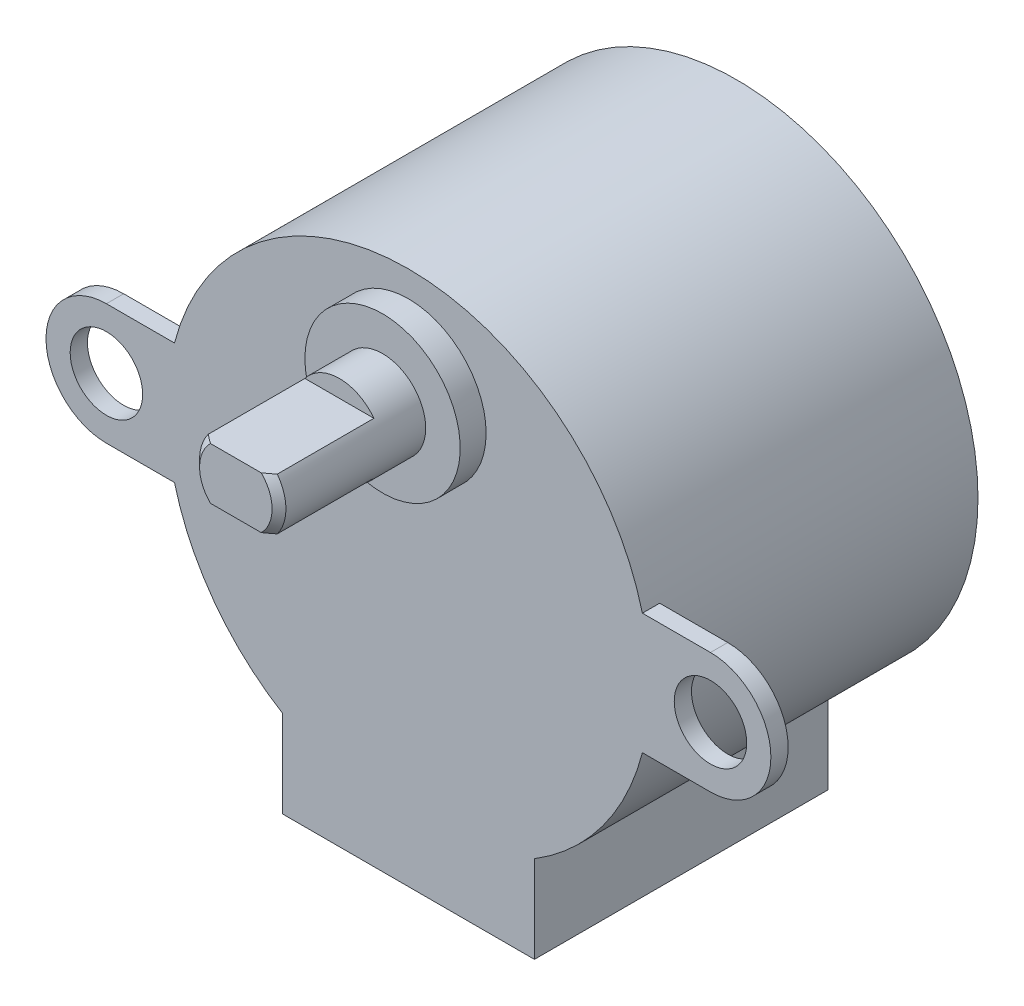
ISO-10303-21;
HEADER;
FILE_DESCRIPTION(('STEP AP214'),'2;1');
FILE_NAME('part.step','',(''),(''),'','','');
FILE_SCHEMA(('AUTOMOTIVE_DESIGN { 1 0 10303 214 1 1 1 1 }'));
ENDSEC;
DATA;
#1=APPLICATION_CONTEXT('core data for automotive mechanical design processes');
#2=APPLICATION_PROTOCOL_DEFINITION('international standard','automotive_design',2000,#1);
#3=PRODUCT_CONTEXT('',#1,'mechanical');
#4=PRODUCT('Part','Part','',(#3));
#5=PRODUCT_RELATED_PRODUCT_CATEGORY('part','',(#4));
#6=PRODUCT_DEFINITION_FORMATION('','',#4);
#7=PRODUCT_DEFINITION_CONTEXT('part definition',#1,'design');
#8=PRODUCT_DEFINITION('design','',#6,#7);
#9=PRODUCT_DEFINITION_SHAPE('','',#8);
#10=(LENGTH_UNIT() NAMED_UNIT(*) SI_UNIT(.MILLI.,.METRE.));
#11=(NAMED_UNIT(*) PLANE_ANGLE_UNIT() SI_UNIT($,.RADIAN.));
#12=(NAMED_UNIT(*) SI_UNIT($,.STERADIAN.) SOLID_ANGLE_UNIT());
#13=UNCERTAINTY_MEASURE_WITH_UNIT(LENGTH_MEASURE(1.E-05),#10,'distance_accuracy_value','');
#14=(GEOMETRIC_REPRESENTATION_CONTEXT(3) GLOBAL_UNCERTAINTY_ASSIGNED_CONTEXT((#13)) GLOBAL_UNIT_ASSIGNED_CONTEXT((#10,
#11,#12)) REPRESENTATION_CONTEXT('',''));
#15=CARTESIAN_POINT('',(0.,0.,0.));
#16=DIRECTION('',(0.,0.,1.));
#17=DIRECTION('',(1.,0.,0.));
#18=AXIS2_PLACEMENT_3D('',#15,#16,#17);
#19=CARTESIAN_POINT('',(0.,0.,19.));
#20=DIRECTION('',(0.,0.,-1.));
#21=DIRECTION('',(-1.,0.,0.));
#22=AXIS2_PLACEMENT_3D('',#19,#20,#21);
#23=CYLINDRICAL_SURFACE('',#22,14.);
#24=CARTESIAN_POINT('',(0.,0.,0.));
#25=DIRECTION('',(0.,0.,1.));
#26=DIRECTION('',(1.,0.,0.));
#27=AXIS2_PLACEMENT_3D('',#24,#25,#26);
#28=CIRCLE('',#27,14.);
#29=CARTESIAN_POINT('',(14.,0.,0.));
#30=VERTEX_POINT('',#29);
#31=EDGE_CURVE('E296',#30,#30,#28,.T.);
#32=ORIENTED_EDGE('',*,*,#31,.T.);
#33=EDGE_LOOP('',(#32));
#34=FACE_BOUND('',#33,.T.);
#35=DIRECTION('',(0.,0.,-1.));
#36=VECTOR('',#35,1.);
#37=CARTESIAN_POINT('',(-7.3,-11.9461290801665,19.));
#38=LINE('',#37,#36);
#39=CARTESIAN_POINT('',(-7.3,-11.9461290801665,19.));
#40=VERTEX_POINT('',#39);
#41=CARTESIAN_POINT('',(-7.3,-11.9461290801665,2.));
#42=VERTEX_POINT('',#41);
#43=EDGE_CURVE('E230',#40,#42,#38,.T.);
#44=ORIENTED_EDGE('',*,*,#43,.F.);
#45=CARTESIAN_POINT('',(0.,0.,19.));
#46=DIRECTION('',(0.,0.,1.));
#47=DIRECTION('',(1.,0.,0.));
#48=AXIS2_PLACEMENT_3D('',#45,#46,#47);
#49=CIRCLE('',#48,14.);
#50=CARTESIAN_POINT('',(-13.555441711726,-3.5,19.));
#51=VERTEX_POINT('',#50);
#52=EDGE_CURVE('E301',#51,#40,#49,.T.);
#53=ORIENTED_EDGE('',*,*,#52,.F.);
#54=DIRECTION('',(0.,0.,-1.));
#55=VECTOR('',#54,1.);
#56=CARTESIAN_POINT('',(-13.555441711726,-3.5,19.));
#57=LINE('',#56,#55);
#58=CARTESIAN_POINT('',(-13.555441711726,-3.5,18.));
#59=VERTEX_POINT('',#58);
#60=EDGE_CURVE('E293',#51,#59,#57,.T.);
#61=ORIENTED_EDGE('',*,*,#60,.T.);
#62=CARTESIAN_POINT('',(0.,0.,18.));
#63=DIRECTION('',(0.,0.,1.));
#64=DIRECTION('',(1.,0.,0.));
#65=AXIS2_PLACEMENT_3D('',#62,#63,#64);
#66=CIRCLE('',#65,14.);
#67=CARTESIAN_POINT('',(-13.555441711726,3.5,18.));
#68=VERTEX_POINT('',#67);
#69=EDGE_CURVE('E306',#68,#59,#66,.T.);
#70=ORIENTED_EDGE('',*,*,#69,.F.);
#71=DIRECTION('',(0.,0.,-1.));
#72=VECTOR('',#71,1.);
#73=CARTESIAN_POINT('',(-13.555441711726,3.5,19.));
#74=LINE('',#73,#72);
#75=CARTESIAN_POINT('',(-13.555441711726,3.5,19.));
#76=VERTEX_POINT('',#75);
#77=EDGE_CURVE('E290',#68,#76,#74,.F.);
#78=ORIENTED_EDGE('',*,*,#77,.T.);
#79=CARTESIAN_POINT('',(13.555441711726,3.5,19.));
#80=VERTEX_POINT('',#79);
#81=EDGE_CURVE('E297',#80,#76,#49,.T.);
#82=ORIENTED_EDGE('',*,*,#81,.F.);
#83=DIRECTION('',(0.,0.,-1.));
#84=VECTOR('',#83,1.);
#85=CARTESIAN_POINT('',(13.555441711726,3.5,19.));
#86=LINE('',#85,#84);
#87=CARTESIAN_POINT('',(13.555441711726,3.5,18.));
#88=VERTEX_POINT('',#87);
#89=EDGE_CURVE('E287',#80,#88,#86,.T.);
#90=ORIENTED_EDGE('',*,*,#89,.T.);
#91=CARTESIAN_POINT('',(13.555441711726,-3.5,18.));
#92=VERTEX_POINT('',#91);
#93=EDGE_CURVE('E300',#92,#88,#66,.T.);
#94=ORIENTED_EDGE('',*,*,#93,.F.);
#95=DIRECTION('',(0.,0.,-1.));
#96=VECTOR('',#95,1.);
#97=CARTESIAN_POINT('',(13.555441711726,-3.5,19.));
#98=LINE('',#97,#96);
#99=CARTESIAN_POINT('',(13.555441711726,-3.5,19.));
#100=VERTEX_POINT('',#99);
#101=EDGE_CURVE('E277',#92,#100,#98,.F.);
#102=ORIENTED_EDGE('',*,*,#101,.T.);
#103=CARTESIAN_POINT('',(7.3,-11.9461290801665,19.));
#104=VERTEX_POINT('',#103);
#105=EDGE_CURVE('E302',#104,#100,#49,.T.);
#106=ORIENTED_EDGE('',*,*,#105,.F.);
#107=DIRECTION('',(0.,0.,-1.));
#108=VECTOR('',#107,1.);
#109=CARTESIAN_POINT('',(7.3,-11.9461290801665,19.));
#110=LINE('',#109,#108);
#111=CARTESIAN_POINT('',(7.3,-11.9461290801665,2.));
#112=VERTEX_POINT('',#111);
#113=EDGE_CURVE('E227',#112,#104,#110,.F.);
#114=ORIENTED_EDGE('',*,*,#113,.F.);
#115=CARTESIAN_POINT('',(0.,0.,2.));
#116=DIRECTION('',(0.,0.,-1.));
#117=DIRECTION('',(-1.,0.,0.));
#118=AXIS2_PLACEMENT_3D('',#115,#116,#117);
#119=CIRCLE('',#118,14.);
#120=EDGE_CURVE('E307',#112,#42,#119,.T.);
#121=ORIENTED_EDGE('',*,*,#120,.T.);
#122=EDGE_LOOP('',(#44,#53,#61,#70,#78,#82,#90,#94,#102,#106,#114,#121));
#123=FACE_BOUND('',#122,.T.);
#124=ADVANCED_FACE('F39',(#34,#123),#23,.T.);
#125=CARTESIAN_POINT('',(0.,0.,19.));
#126=DIRECTION('',(0.,0.,1.));
#127=DIRECTION('',(1.,0.,0.));
#128=AXIS2_PLACEMENT_3D('',#125,#126,#127);
#129=PLANE('',#128);
#130=CARTESIAN_POINT('',(0.,8.,19.));
#131=DIRECTION('',(0.,0.,1.));
#132=DIRECTION('',(1.,0.,0.));
#133=AXIS2_PLACEMENT_3D('',#130,#131,#132);
#134=CIRCLE('',#133,4.5);
#135=CARTESIAN_POINT('',(4.5,8.,19.));
#136=VERTEX_POINT('',#135);
#137=EDGE_CURVE('E205',#136,#136,#134,.T.);
#138=ORIENTED_EDGE('',*,*,#137,.F.);
#139=EDGE_LOOP('',(#138));
#140=FACE_BOUND('',#139,.T.);
#141=ORIENTED_EDGE('',*,*,#52,.T.);
#142=DIRECTION('',(0.,1.,0.));
#143=VECTOR('',#142,1.);
#144=CARTESIAN_POINT('',(-7.3,-11.,19.));
#145=LINE('',#144,#143);
#146=CARTESIAN_POINT('',(-7.3,-17.,19.));
#147=VERTEX_POINT('',#146);
#148=EDGE_CURVE('E208',#147,#40,#145,.T.);
#149=ORIENTED_EDGE('',*,*,#148,.F.);
#150=DIRECTION('',(-1.,0.,0.));
#151=VECTOR('',#150,1.);
#152=CARTESIAN_POINT('',(7.3,-17.,19.));
#153=LINE('',#152,#151);
#154=CARTESIAN_POINT('',(7.3,-17.,19.));
#155=VERTEX_POINT('',#154);
#156=EDGE_CURVE('E213',#155,#147,#153,.T.);
#157=ORIENTED_EDGE('',*,*,#156,.F.);
#158=DIRECTION('',(0.,-1.,0.));
#159=VECTOR('',#158,1.);
#160=CARTESIAN_POINT('',(7.3,-11.,19.));
#161=LINE('',#160,#159);
#162=EDGE_CURVE('E219',#104,#155,#161,.T.);
#163=ORIENTED_EDGE('',*,*,#162,.F.);
#164=ORIENTED_EDGE('',*,*,#105,.T.);
#165=DIRECTION('',(1.,0.,0.));
#166=VECTOR('',#165,1.);
#167=CARTESIAN_POINT('',(13.0384048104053,-3.5,19.));
#168=LINE('',#167,#166);
#169=CARTESIAN_POINT('',(17.5,-3.5,19.));
#170=VERTEX_POINT('',#169);
#171=EDGE_CURVE('E236',#100,#170,#168,.T.);
#172=ORIENTED_EDGE('',*,*,#171,.T.);
#173=CARTESIAN_POINT('',(17.5,0.,19.));
#174=DIRECTION('',(0.,0.,1.));
#175=DIRECTION('',(-1.,0.,0.));
#176=AXIS2_PLACEMENT_3D('',#173,#174,#175);
#177=CIRCLE('',#176,3.5);
#178=CARTESIAN_POINT('',(17.5,3.5,19.));
#179=VERTEX_POINT('',#178);
#180=EDGE_CURVE('E264',#170,#179,#177,.T.);
#181=ORIENTED_EDGE('',*,*,#180,.T.);
#182=DIRECTION('',(-1.,0.,0.));
#183=VECTOR('',#182,1.);
#184=CARTESIAN_POINT('',(13.0384048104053,3.5,19.));
#185=LINE('',#184,#183);
#186=EDGE_CURVE('E267',#179,#80,#185,.T.);
#187=ORIENTED_EDGE('',*,*,#186,.T.);
#188=ORIENTED_EDGE('',*,*,#81,.T.);
#189=DIRECTION('',(-1.,0.,0.));
#190=VECTOR('',#189,1.);
#191=CARTESIAN_POINT('',(-17.5,3.5,19.));
#192=LINE('',#191,#190);
#193=CARTESIAN_POINT('',(-17.5,3.5,19.));
#194=VERTEX_POINT('',#193);
#195=EDGE_CURVE('E269',#76,#194,#192,.T.);
#196=ORIENTED_EDGE('',*,*,#195,.T.);
#197=CARTESIAN_POINT('',(-17.5,0.,19.));
#198=DIRECTION('',(0.,0.,1.));
#199=DIRECTION('',(-1.,0.,0.));
#200=AXIS2_PLACEMENT_3D('',#197,#198,#199);
#201=CIRCLE('',#200,3.5);
#202=CARTESIAN_POINT('',(-17.5,-3.5,19.));
#203=VERTEX_POINT('',#202);
#204=EDGE_CURVE('E271',#194,#203,#201,.T.);
#205=ORIENTED_EDGE('',*,*,#204,.T.);
#206=DIRECTION('',(1.,0.,0.));
#207=VECTOR('',#206,1.);
#208=CARTESIAN_POINT('',(-17.5,-3.5,19.));
#209=LINE('',#208,#207);
#210=EDGE_CURVE('E248',#203,#51,#209,.T.);
#211=ORIENTED_EDGE('',*,*,#210,.T.);
#212=EDGE_LOOP('',(#141,#149,#157,#163,#164,#172,#181,#187,#188,#196,#205,#211));
#213=FACE_BOUND('',#212,.T.);
#214=CARTESIAN_POINT('',(17.5,0.,19.));
#215=DIRECTION('',(0.,0.,-1.));
#216=DIRECTION('',(-1.,0.,0.));
#217=AXIS2_PLACEMENT_3D('',#214,#215,#216);
#218=CIRCLE('',#217,2.1);
#219=CARTESIAN_POINT('',(15.4,0.,19.));
#220=VERTEX_POINT('',#219);
#221=EDGE_CURVE('E233',#220,#220,#218,.T.);
#222=ORIENTED_EDGE('',*,*,#221,.T.);
#223=EDGE_LOOP('',(#222));
#224=FACE_BOUND('',#223,.T.);
#225=CARTESIAN_POINT('',(-17.5,0.,19.));
#226=DIRECTION('',(0.,0.,-1.));
#227=DIRECTION('',(-1.,0.,0.));
#228=AXIS2_PLACEMENT_3D('',#225,#226,#227);
#229=CIRCLE('',#228,2.1);
#230=CARTESIAN_POINT('',(-19.6,0.,19.));
#231=VERTEX_POINT('',#230);
#232=EDGE_CURVE('E232',#231,#231,#229,.T.);
#233=ORIENTED_EDGE('',*,*,#232,.T.);
#234=EDGE_LOOP('',(#233));
#235=FACE_BOUND('',#234,.T.);
#236=ADVANCED_FACE('F413',(#140,#213,#224,#235),#129,.T.);
#237=CARTESIAN_POINT('',(0.,0.,0.));
#238=DIRECTION('',(0.,0.,1.));
#239=DIRECTION('',(1.,0.,0.));
#240=AXIS2_PLACEMENT_3D('',#237,#238,#239);
#241=PLANE('',#240);
#242=ORIENTED_EDGE('',*,*,#31,.F.);
#243=EDGE_LOOP('',(#242));
#244=FACE_BOUND('',#243,.T.);
#245=ADVANCED_FACE('F408',(#244),#241,.F.);
#246=CARTESIAN_POINT('',(17.5,0.,18.));
#247=DIRECTION('',(0.,0.,1.));
#248=DIRECTION('',(1.,0.,0.));
#249=AXIS2_PLACEMENT_3D('',#246,#247,#248);
#250=CYLINDRICAL_SURFACE('',#249,3.5);
#251=ORIENTED_EDGE('',*,*,#180,.F.);
#252=DIRECTION('',(0.,0.,1.));
#253=VECTOR('',#252,1.);
#254=CARTESIAN_POINT('',(17.5,-3.5,18.));
#255=LINE('',#254,#253);
#256=CARTESIAN_POINT('',(17.5,-3.5,18.));
#257=VERTEX_POINT('',#256);
#258=EDGE_CURVE('E262',#257,#170,#255,.T.);
#259=ORIENTED_EDGE('',*,*,#258,.F.);
#260=CARTESIAN_POINT('',(17.5,0.,18.));
#261=DIRECTION('',(0.,0.,1.));
#262=DIRECTION('',(-1.,0.,0.));
#263=AXIS2_PLACEMENT_3D('',#260,#261,#262);
#264=CIRCLE('',#263,3.5);
#265=CARTESIAN_POINT('',(17.5,3.5,18.));
#266=VERTEX_POINT('',#265);
#267=EDGE_CURVE('E247',#257,#266,#264,.T.);
#268=ORIENTED_EDGE('',*,*,#267,.T.);
#269=DIRECTION('',(0.,0.,1.));
#270=VECTOR('',#269,1.);
#271=CARTESIAN_POINT('',(17.5,3.5,18.));
#272=LINE('',#271,#270);
#273=EDGE_CURVE('E281',#266,#179,#272,.T.);
#274=ORIENTED_EDGE('',*,*,#273,.T.);
#275=EDGE_LOOP('',(#251,#259,#268,#274));
#276=FACE_BOUND('',#275,.T.);
#277=ADVANCED_FACE('F388',(#276),#250,.T.);
#278=CARTESIAN_POINT('',(0.,0.,18.));
#279=DIRECTION('',(0.,0.,1.));
#280=DIRECTION('',(1.,0.,0.));
#281=AXIS2_PLACEMENT_3D('',#278,#279,#280);
#282=PLANE('',#281);
#283=CARTESIAN_POINT('',(17.5,0.,18.));
#284=DIRECTION('',(0.,0.,-1.));
#285=DIRECTION('',(-1.,0.,0.));
#286=AXIS2_PLACEMENT_3D('',#283,#284,#285);
#287=CIRCLE('',#286,2.1);
#288=CARTESIAN_POINT('',(15.4,0.,18.));
#289=VERTEX_POINT('',#288);
#290=EDGE_CURVE('E237',#289,#289,#287,.T.);
#291=ORIENTED_EDGE('',*,*,#290,.F.);
#292=EDGE_LOOP('',(#291));
#293=FACE_BOUND('',#292,.T.);
#294=DIRECTION('',(1.,0.,0.));
#295=VECTOR('',#294,1.);
#296=CARTESIAN_POINT('',(13.0384048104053,-3.5,18.));
#297=LINE('',#296,#295);
#298=EDGE_CURVE('E245',#92,#257,#297,.T.);
#299=ORIENTED_EDGE('',*,*,#298,.F.);
#300=ORIENTED_EDGE('',*,*,#93,.T.);
#301=DIRECTION('',(-1.,0.,0.));
#302=VECTOR('',#301,1.);
#303=CARTESIAN_POINT('',(13.0384048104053,3.5,18.));
#304=LINE('',#303,#302);
#305=EDGE_CURVE('E251',#266,#88,#304,.T.);
#306=ORIENTED_EDGE('',*,*,#305,.F.);
#307=ORIENTED_EDGE('',*,*,#267,.F.);
#308=EDGE_LOOP('',(#299,#300,#306,#307));
#309=FACE_BOUND('',#308,.T.);
#310=ADVANCED_FACE('F384',(#293,#309),#282,.F.);
#311=CARTESIAN_POINT('',(13.0384048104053,-3.5,18.));
#312=DIRECTION('',(0.,-1.,0.));
#313=DIRECTION('',(0.,0.,-1.));
#314=AXIS2_PLACEMENT_3D('',#311,#312,#313);
#315=PLANE('',#314);
#316=ORIENTED_EDGE('',*,*,#101,.F.);
#317=ORIENTED_EDGE('',*,*,#298,.T.);
#318=ORIENTED_EDGE('',*,*,#258,.T.);
#319=ORIENTED_EDGE('',*,*,#171,.F.);
#320=EDGE_LOOP('',(#316,#317,#318,#319));
#321=FACE_BOUND('',#320,.T.);
#322=ADVANCED_FACE('F387',(#321),#315,.T.);
#323=CARTESIAN_POINT('',(13.0384048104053,3.5,18.));
#324=DIRECTION('',(0.,1.,0.));
#325=DIRECTION('',(0.,0.,1.));
#326=AXIS2_PLACEMENT_3D('',#323,#324,#325);
#327=PLANE('',#326);
#328=ORIENTED_EDGE('',*,*,#89,.F.);
#329=ORIENTED_EDGE('',*,*,#186,.F.);
#330=ORIENTED_EDGE('',*,*,#273,.F.);
#331=ORIENTED_EDGE('',*,*,#305,.T.);
#332=EDGE_LOOP('',(#328,#329,#330,#331));
#333=FACE_BOUND('',#332,.T.);
#334=ADVANCED_FACE('F402',(#333),#327,.T.);
#335=CARTESIAN_POINT('',(-17.5,0.,18.));
#336=DIRECTION('',(0.,0.,-1.));
#337=DIRECTION('',(-1.,0.,0.));
#338=AXIS2_PLACEMENT_3D('',#335,#336,#337);
#339=CIRCLE('',#338,2.1);
#340=CARTESIAN_POINT('',(-19.6,0.,18.));
#341=VERTEX_POINT('',#340);
#342=EDGE_CURVE('E240',#341,#341,#339,.T.);
#343=ORIENTED_EDGE('',*,*,#342,.F.);
#344=EDGE_LOOP('',(#343));
#345=FACE_BOUND('',#344,.T.);
#346=DIRECTION('',(-1.,0.,0.));
#347=VECTOR('',#346,1.);
#348=CARTESIAN_POINT('',(-17.5,3.5,18.));
#349=LINE('',#348,#347);
#350=CARTESIAN_POINT('',(-17.5,3.5,18.));
#351=VERTEX_POINT('',#350);
#352=EDGE_CURVE('E254',#68,#351,#349,.T.);
#353=ORIENTED_EDGE('',*,*,#352,.F.);
#354=ORIENTED_EDGE('',*,*,#69,.T.);
#355=DIRECTION('',(1.,0.,0.));
#356=VECTOR('',#355,1.);
#357=CARTESIAN_POINT('',(-17.5,-3.5,18.));
#358=LINE('',#357,#356);
#359=CARTESIAN_POINT('',(-17.5,-3.5,18.));
#360=VERTEX_POINT('',#359);
#361=EDGE_CURVE('E259',#360,#59,#358,.T.);
#362=ORIENTED_EDGE('',*,*,#361,.F.);
#363=CARTESIAN_POINT('',(-17.5,0.,18.));
#364=DIRECTION('',(0.,0.,1.));
#365=DIRECTION('',(-1.,0.,0.));
#366=AXIS2_PLACEMENT_3D('',#363,#364,#365);
#367=CIRCLE('',#366,3.5);
#368=EDGE_CURVE('E256',#351,#360,#367,.T.);
#369=ORIENTED_EDGE('',*,*,#368,.F.);
#370=EDGE_LOOP('',(#353,#354,#362,#369));
#371=FACE_BOUND('',#370,.T.);
#372=ADVANCED_FACE('F390',(#345,#371),#282,.F.);
#373=CARTESIAN_POINT('',(-17.5,-3.5,18.));
#374=DIRECTION('',(0.,-1.,0.));
#375=DIRECTION('',(0.,0.,-1.));
#376=AXIS2_PLACEMENT_3D('',#373,#374,#375);
#377=PLANE('',#376);
#378=ORIENTED_EDGE('',*,*,#60,.F.);
#379=ORIENTED_EDGE('',*,*,#210,.F.);
#380=DIRECTION('',(0.,0.,1.));
#381=VECTOR('',#380,1.);
#382=CARTESIAN_POINT('',(-17.5,-3.5,18.));
#383=LINE('',#382,#381);
#384=EDGE_CURVE('E275',#360,#203,#383,.T.);
#385=ORIENTED_EDGE('',*,*,#384,.F.);
#386=ORIENTED_EDGE('',*,*,#361,.T.);
#387=EDGE_LOOP('',(#378,#379,#385,#386));
#388=FACE_BOUND('',#387,.T.);
#389=ADVANCED_FACE('F391',(#388),#377,.T.);
#390=CARTESIAN_POINT('',(-17.5,3.5,18.));
#391=DIRECTION('',(0.,1.,0.));
#392=DIRECTION('',(0.,0.,1.));
#393=AXIS2_PLACEMENT_3D('',#390,#391,#392);
#394=PLANE('',#393);
#395=ORIENTED_EDGE('',*,*,#77,.F.);
#396=ORIENTED_EDGE('',*,*,#352,.T.);
#397=DIRECTION('',(0.,0.,1.));
#398=VECTOR('',#397,1.);
#399=CARTESIAN_POINT('',(-17.5,3.5,18.));
#400=LINE('',#399,#398);
#401=EDGE_CURVE('E278',#351,#194,#400,.T.);
#402=ORIENTED_EDGE('',*,*,#401,.T.);
#403=ORIENTED_EDGE('',*,*,#195,.F.);
#404=EDGE_LOOP('',(#395,#396,#402,#403));
#405=FACE_BOUND('',#404,.T.);
#406=ADVANCED_FACE('F394',(#405),#394,.T.);
#407=CARTESIAN_POINT('',(-17.5,0.,18.));
#408=DIRECTION('',(0.,0.,1.));
#409=DIRECTION('',(1.,0.,0.));
#410=AXIS2_PLACEMENT_3D('',#407,#408,#409);
#411=CYLINDRICAL_SURFACE('',#410,3.5);
#412=ORIENTED_EDGE('',*,*,#204,.F.);
#413=ORIENTED_EDGE('',*,*,#401,.F.);
#414=ORIENTED_EDGE('',*,*,#368,.T.);
#415=ORIENTED_EDGE('',*,*,#384,.T.);
#416=EDGE_LOOP('',(#412,#413,#414,#415));
#417=FACE_BOUND('',#416,.T.);
#418=ADVANCED_FACE('F382',(#417),#411,.T.);
#419=CARTESIAN_POINT('',(-17.5,0.,19.));
#420=DIRECTION('',(0.,0.,-1.));
#421=DIRECTION('',(-1.,0.,0.));
#422=AXIS2_PLACEMENT_3D('',#419,#420,#421);
#423=CYLINDRICAL_SURFACE('',#422,2.1);
#424=ORIENTED_EDGE('',*,*,#232,.F.);
#425=EDGE_LOOP('',(#424));
#426=FACE_BOUND('',#425,.T.);
#427=ORIENTED_EDGE('',*,*,#342,.T.);
#428=EDGE_LOOP('',(#427));
#429=FACE_BOUND('',#428,.T.);
#430=ADVANCED_FACE('F378',(#426,#429),#423,.F.);
#431=CARTESIAN_POINT('',(17.5,0.,19.));
#432=DIRECTION('',(0.,0.,-1.));
#433=DIRECTION('',(-1.,0.,0.));
#434=AXIS2_PLACEMENT_3D('',#431,#432,#433);
#435=CYLINDRICAL_SURFACE('',#434,2.1);
#436=ORIENTED_EDGE('',*,*,#221,.F.);
#437=EDGE_LOOP('',(#436));
#438=FACE_BOUND('',#437,.T.);
#439=ORIENTED_EDGE('',*,*,#290,.T.);
#440=EDGE_LOOP('',(#439));
#441=FACE_BOUND('',#440,.T.);
#442=ADVANCED_FACE('F374',(#438,#441),#435,.F.);
#443=CARTESIAN_POINT('',(-7.3,-11.,2.));
#444=DIRECTION('',(1.,0.,0.));
#445=DIRECTION('',(0.,0.,-1.));
#446=AXIS2_PLACEMENT_3D('',#443,#444,#445);
#447=PLANE('',#446);
#448=ORIENTED_EDGE('',*,*,#148,.T.);
#449=ORIENTED_EDGE('',*,*,#43,.T.);
#450=DIRECTION('',(0.,1.,0.));
#451=VECTOR('',#450,1.);
#452=CARTESIAN_POINT('',(-7.3,-11.,2.));
#453=LINE('',#452,#451);
#454=CARTESIAN_POINT('',(-7.3,-17.,2.));
#455=VERTEX_POINT('',#454);
#456=EDGE_CURVE('E209',#455,#42,#453,.T.);
#457=ORIENTED_EDGE('',*,*,#456,.F.);
#458=DIRECTION('',(0.,0.,1.));
#459=VECTOR('',#458,1.);
#460=CARTESIAN_POINT('',(-7.3,-17.,2.));
#461=LINE('',#460,#459);
#462=EDGE_CURVE('E217',#455,#147,#461,.T.);
#463=ORIENTED_EDGE('',*,*,#462,.T.);
#464=EDGE_LOOP('',(#448,#449,#457,#463));
#465=FACE_BOUND('',#464,.T.);
#466=ADVANCED_FACE('F370',(#465),#447,.F.);
#467=CARTESIAN_POINT('',(7.3,-11.,2.));
#468=DIRECTION('',(-1.,0.,0.));
#469=DIRECTION('',(0.,0.,1.));
#470=AXIS2_PLACEMENT_3D('',#467,#468,#469);
#471=PLANE('',#470);
#472=DIRECTION('',(0.,-1.,0.));
#473=VECTOR('',#472,1.);
#474=CARTESIAN_POINT('',(7.3,-11.,2.));
#475=LINE('',#474,#473);
#476=CARTESIAN_POINT('',(7.3,-17.,2.));
#477=VERTEX_POINT('',#476);
#478=EDGE_CURVE('E212',#112,#477,#475,.T.);
#479=ORIENTED_EDGE('',*,*,#478,.F.);
#480=ORIENTED_EDGE('',*,*,#113,.T.);
#481=ORIENTED_EDGE('',*,*,#162,.T.);
#482=DIRECTION('',(0.,0.,1.));
#483=VECTOR('',#482,1.);
#484=CARTESIAN_POINT('',(7.3,-17.,2.));
#485=LINE('',#484,#483);
#486=EDGE_CURVE('E224',#477,#155,#485,.T.);
#487=ORIENTED_EDGE('',*,*,#486,.F.);
#488=EDGE_LOOP('',(#479,#480,#481,#487));
#489=FACE_BOUND('',#488,.T.);
#490=ADVANCED_FACE('F366',(#489),#471,.F.);
#491=CARTESIAN_POINT('',(7.3,-17.,2.));
#492=DIRECTION('',(0.,1.,0.));
#493=DIRECTION('',(0.,0.,1.));
#494=AXIS2_PLACEMENT_3D('',#491,#492,#493);
#495=PLANE('',#494);
#496=ORIENTED_EDGE('',*,*,#156,.T.);
#497=ORIENTED_EDGE('',*,*,#462,.F.);
#498=DIRECTION('',(-1.,0.,0.));
#499=VECTOR('',#498,1.);
#500=CARTESIAN_POINT('',(7.3,-17.,2.));
#501=LINE('',#500,#499);
#502=EDGE_CURVE('E215',#477,#455,#501,.T.);
#503=ORIENTED_EDGE('',*,*,#502,.F.);
#504=ORIENTED_EDGE('',*,*,#486,.T.);
#505=EDGE_LOOP('',(#496,#497,#503,#504));
#506=FACE_BOUND('',#505,.T.);
#507=ADVANCED_FACE('F362',(#506),#495,.F.);
#508=CARTESIAN_POINT('',(0.,0.,2.));
#509=DIRECTION('',(0.,0.,-1.));
#510=DIRECTION('',(-1.,0.,0.));
#511=AXIS2_PLACEMENT_3D('',#508,#509,#510);
#512=PLANE('',#511);
#513=ORIENTED_EDGE('',*,*,#120,.F.);
#514=ORIENTED_EDGE('',*,*,#478,.T.);
#515=ORIENTED_EDGE('',*,*,#502,.T.);
#516=ORIENTED_EDGE('',*,*,#456,.T.);
#517=EDGE_LOOP('',(#513,#514,#515,#516));
#518=FACE_BOUND('',#517,.T.);
#519=ADVANCED_FACE('F358',(#518),#512,.T.);
#520=CARTESIAN_POINT('',(0.,8.,20.5));
#521=DIRECTION('',(0.,0.,-1.));
#522=DIRECTION('',(-1.,0.,0.));
#523=AXIS2_PLACEMENT_3D('',#520,#521,#522);
#524=CYLINDRICAL_SURFACE('',#523,4.5);
#525=CARTESIAN_POINT('',(0.,8.,20.5));
#526=DIRECTION('',(0.,0.,-1.));
#527=DIRECTION('',(-1.,0.,0.));
#528=AXIS2_PLACEMENT_3D('',#525,#526,#527);
#529=CIRCLE('',#528,4.5);
#530=CARTESIAN_POINT('',(-4.5,8.,20.5));
#531=VERTEX_POINT('',#530);
#532=EDGE_CURVE('E200',#531,#531,#529,.T.);
#533=ORIENTED_EDGE('',*,*,#532,.T.);
#534=EDGE_LOOP('',(#533));
#535=FACE_BOUND('',#534,.T.);
#536=ORIENTED_EDGE('',*,*,#137,.T.);
#537=EDGE_LOOP('',(#536));
#538=FACE_BOUND('',#537,.T.);
#539=ADVANCED_FACE('F354',(#535,#538),#524,.T.);
#540=CARTESIAN_POINT('',(0.,8.,20.5));
#541=DIRECTION('',(0.,0.,-1.));
#542=DIRECTION('',(-1.,0.,0.));
#543=AXIS2_PLACEMENT_3D('',#540,#541,#542);
#544=PLANE('',#543);
#545=CARTESIAN_POINT('',(0.,8.,20.5));
#546=DIRECTION('',(0.,0.,1.));
#547=DIRECTION('',(1.,0.,0.));
#548=AXIS2_PLACEMENT_3D('',#545,#546,#547);
#549=CIRCLE('',#548,2.5);
#550=CARTESIAN_POINT('',(2.5,8.,20.5));
#551=VERTEX_POINT('',#550);
#552=EDGE_CURVE('E201',#551,#551,#549,.T.);
#553=ORIENTED_EDGE('',*,*,#552,.F.);
#554=EDGE_LOOP('',(#553));
#555=FACE_BOUND('',#554,.T.);
#556=ORIENTED_EDGE('',*,*,#532,.F.);
#557=EDGE_LOOP('',(#556));
#558=FACE_BOUND('',#557,.T.);
#559=ADVANCED_FACE('F351',(#555,#558),#544,.F.);
#560=CARTESIAN_POINT('',(0.,8.,29.));
#561=DIRECTION('',(0.,0.,-1.));
#562=DIRECTION('',(-1.,0.,0.));
#563=AXIS2_PLACEMENT_3D('',#560,#561,#562);
#564=CYLINDRICAL_SURFACE('',#563,2.5);
#565=DIRECTION('',(0.,0.,-1.));
#566=VECTOR('',#565,1.);
#567=CARTESIAN_POINT('',(-2.,6.5,29.));
#568=LINE('',#567,#566);
#569=CARTESIAN_POINT('',(-2.,6.5,23.));
#570=VERTEX_POINT('',#569);
#571=CARTESIAN_POINT('',(-2.,6.5,28.6));
#572=VERTEX_POINT('',#571);
#573=EDGE_CURVE('E180',#570,#572,#568,.F.);
#574=ORIENTED_EDGE('',*,*,#573,.T.);
#575=CARTESIAN_POINT('',(0.,8.,28.6));
#576=DIRECTION('',(0.,0.,1.));
#577=DIRECTION('',(1.,0.,0.));
#578=AXIS2_PLACEMENT_3D('',#575,#576,#577);
#579=CIRCLE('',#578,2.5);
#580=CARTESIAN_POINT('',(-2.,9.50000000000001,28.6));
#581=VERTEX_POINT('',#580);
#582=EDGE_CURVE('E68',#572,#581,#579,.F.);
#583=ORIENTED_EDGE('',*,*,#582,.T.);
#584=DIRECTION('',(0.,0.,-1.));
#585=VECTOR('',#584,1.);
#586=CARTESIAN_POINT('',(-2.,9.50000000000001,29.));
#587=LINE('',#586,#585);
#588=CARTESIAN_POINT('',(-2.,9.50000000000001,23.));
#589=VERTEX_POINT('',#588);
#590=EDGE_CURVE('E198',#581,#589,#587,.T.);
#591=ORIENTED_EDGE('',*,*,#590,.T.);
#592=CARTESIAN_POINT('',(0.,8.,23.));
#593=DIRECTION('',(0.,0.,1.));
#594=DIRECTION('',(1.,0.,0.));
#595=AXIS2_PLACEMENT_3D('',#592,#593,#594);
#596=CIRCLE('',#595,2.5);
#597=CARTESIAN_POINT('',(2.,9.50000000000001,23.));
#598=VERTEX_POINT('',#597);
#599=EDGE_CURVE('E186',#598,#589,#596,.T.);
#600=ORIENTED_EDGE('',*,*,#599,.F.);
#601=DIRECTION('',(0.,0.,-1.));
#602=VECTOR('',#601,1.);
#603=CARTESIAN_POINT('',(2.,9.50000000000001,29.));
#604=LINE('',#603,#602);
#605=CARTESIAN_POINT('',(2.,9.50000000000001,28.6));
#606=VERTEX_POINT('',#605);
#607=EDGE_CURVE('E179',#598,#606,#604,.F.);
#608=ORIENTED_EDGE('',*,*,#607,.T.);
#609=CARTESIAN_POINT('',(0.,8.,28.6));
#610=DIRECTION('',(0.,0.,1.));
#611=DIRECTION('',(1.,0.,0.));
#612=AXIS2_PLACEMENT_3D('',#609,#610,#611);
#613=CIRCLE('',#612,2.5);
#614=CARTESIAN_POINT('',(2.,6.5,28.6));
#615=VERTEX_POINT('',#614);
#616=EDGE_CURVE('E175',#606,#615,#613,.F.);
#617=ORIENTED_EDGE('',*,*,#616,.T.);
#618=DIRECTION('',(0.,0.,-1.));
#619=VECTOR('',#618,1.);
#620=CARTESIAN_POINT('',(2.,6.5,29.));
#621=LINE('',#620,#619);
#622=CARTESIAN_POINT('',(2.,6.5,23.));
#623=VERTEX_POINT('',#622);
#624=EDGE_CURVE('E169',#615,#623,#621,.T.);
#625=ORIENTED_EDGE('',*,*,#624,.T.);
#626=CARTESIAN_POINT('',(0.,8.,23.));
#627=DIRECTION('',(0.,0.,1.));
#628=DIRECTION('',(1.,0.,0.));
#629=AXIS2_PLACEMENT_3D('',#626,#627,#628);
#630=CIRCLE('',#629,2.5);
#631=EDGE_CURVE('E173',#570,#623,#630,.T.);
#632=ORIENTED_EDGE('',*,*,#631,.F.);
#633=EDGE_LOOP('',(#574,#583,#591,#600,#608,#617,#625,#632));
#634=FACE_BOUND('',#633,.T.);
#635=ORIENTED_EDGE('',*,*,#552,.T.);
#636=EDGE_LOOP('',(#635));
#637=FACE_BOUND('',#636,.T.);
#638=ADVANCED_FACE('F171',(#634,#637),#564,.T.);
#639=CARTESIAN_POINT('',(0.,8.,29.));
#640=DIRECTION('',(0.,0.,1.));
#641=DIRECTION('',(1.,0.,0.));
#642=AXIS2_PLACEMENT_3D('',#639,#640,#641);
#643=PLANE('',#642);
#644=DIRECTION('',(1.,0.,0.));
#645=VECTOR('',#644,1.);
#646=CARTESIAN_POINT('',(0.,9.50000000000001,29.));
#647=LINE('',#646,#645);
#648=CARTESIAN_POINT('',(-1.4696938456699,9.50000000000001,29.));
#649=VERTEX_POINT('',#648);
#650=CARTESIAN_POINT('',(1.4696938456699,9.50000000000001,29.));
#651=VERTEX_POINT('',#650);
#652=EDGE_CURVE('E187',#649,#651,#647,.T.);
#653=ORIENTED_EDGE('',*,*,#652,.F.);
#654=CARTESIAN_POINT('',(0.,8.,29.));
#655=DIRECTION('',(0.,0.,1.));
#656=DIRECTION('',(1.,0.,0.));
#657=AXIS2_PLACEMENT_3D('',#654,#655,#656);
#658=CIRCLE('',#657,2.1);
#659=CARTESIAN_POINT('',(-1.4696938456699,6.5,29.));
#660=VERTEX_POINT('',#659);
#661=EDGE_CURVE('E319',#649,#660,#658,.T.);
#662=ORIENTED_EDGE('',*,*,#661,.T.);
#663=DIRECTION('',(-1.,0.,0.));
#664=VECTOR('',#663,1.);
#665=CARTESIAN_POINT('',(0.,6.5,29.));
#666=LINE('',#665,#664);
#667=CARTESIAN_POINT('',(1.4696938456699,6.5,29.));
#668=VERTEX_POINT('',#667);
#669=EDGE_CURVE('E204',#668,#660,#666,.T.);
#670=ORIENTED_EDGE('',*,*,#669,.F.);
#671=CARTESIAN_POINT('',(0.,8.,29.));
#672=DIRECTION('',(0.,0.,1.));
#673=DIRECTION('',(1.,0.,0.));
#674=AXIS2_PLACEMENT_3D('',#671,#672,#673);
#675=CIRCLE('',#674,2.1);
#676=EDGE_CURVE('E316',#668,#651,#675,.T.);
#677=ORIENTED_EDGE('',*,*,#676,.T.);
#678=EDGE_LOOP('',(#653,#662,#670,#677));
#679=FACE_BOUND('',#678,.T.);
#680=ADVANCED_FACE('F345',(#679),#643,.T.);
#681=CARTESIAN_POINT('',(0.,0.,23.));
#682=DIRECTION('',(0.,0.,1.));
#683=DIRECTION('',(1.,0.,0.));
#684=AXIS2_PLACEMENT_3D('',#681,#682,#683);
#685=PLANE('',#684);
#686=ORIENTED_EDGE('',*,*,#631,.T.);
#687=DIRECTION('',(-1.,0.,0.));
#688=VECTOR('',#687,1.);
#689=CARTESIAN_POINT('',(-2.5,6.5,23.));
#690=LINE('',#689,#688);
#691=EDGE_CURVE('E185',#623,#570,#690,.T.);
#692=ORIENTED_EDGE('',*,*,#691,.T.);
#693=EDGE_LOOP('',(#686,#692));
#694=FACE_BOUND('',#693,.T.);
#695=ADVANCED_FACE('F184',(#694),#685,.T.);
#696=CARTESIAN_POINT('',(-2.5,6.5,23.));
#697=DIRECTION('',(0.,1.,0.));
#698=DIRECTION('',(0.,0.,1.));
#699=AXIS2_PLACEMENT_3D('',#696,#697,#698);
#700=PLANE('',#699);
#701=ORIENTED_EDGE('',*,*,#669,.T.);
#702=CARTESIAN_POINT('',(-1.4696938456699,6.5,29.));
#703=CARTESIAN_POINT('',(-1.51505738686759,6.5,28.9682437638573));
#704=CARTESIAN_POINT('',(-1.56007362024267,6.5,28.9359975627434));
#705=CARTESIAN_POINT('',(-1.64948691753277,6.5,28.8706803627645));
#706=CARTESIAN_POINT('',(-1.69388413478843,6.5,28.8376095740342));
#707=CARTESIAN_POINT('',(-1.78215479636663,6.5,28.7707843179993));
#708=CARTESIAN_POINT('',(-1.82602827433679,6.5,28.7370298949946));
#709=CARTESIAN_POINT('',(-1.91333240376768,6.5,28.6689302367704));
#710=CARTESIAN_POINT('',(-1.9567629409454,6.5,28.6345848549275));
#711=CARTESIAN_POINT('',(-2.,6.5,28.6));
#712=B_SPLINE_CURVE_WITH_KNOTS('',3,(#702,#703,#704,#705,#706,#707,#708,#709,#710,#711),
.UNSPECIFIED.,.F.,.F.,(4,2,2,2,4),(0.,0.166114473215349,0.332187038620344,0.498248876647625,
0.664352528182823),.UNSPECIFIED.);
#713=EDGE_CURVE('E329',#660,#572,#712,.T.);
#714=ORIENTED_EDGE('',*,*,#713,.T.);
#715=ORIENTED_EDGE('',*,*,#573,.F.);
#716=ORIENTED_EDGE('',*,*,#691,.F.);
#717=ORIENTED_EDGE('',*,*,#624,.F.);
#718=CARTESIAN_POINT('',(2.,6.5,28.6));
#719=CARTESIAN_POINT('',(1.95676294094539,6.5,28.6345848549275));
#720=CARTESIAN_POINT('',(1.91333240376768,6.5,28.6689302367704));
#721=CARTESIAN_POINT('',(1.82602827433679,6.5,28.7370298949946));
#722=CARTESIAN_POINT('',(1.78215479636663,6.5,28.7707843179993));
#723=CARTESIAN_POINT('',(1.69388413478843,6.5,28.8376095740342));
#724=CARTESIAN_POINT('',(1.64948691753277,6.5,28.8706803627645));
#725=CARTESIAN_POINT('',(1.56007362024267,6.5,28.9359975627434));
#726=CARTESIAN_POINT('',(1.51505738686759,6.5,28.9682437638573));
#727=CARTESIAN_POINT('',(1.4696938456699,6.5,29.));
#728=B_SPLINE_CURVE_WITH_KNOTS('',3,(#718,#719,#720,#721,#722,#723,#724,#725,#726,#727),
.UNSPECIFIED.,.F.,.F.,(4,2,2,2,4),(0.,0.166103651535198,0.332165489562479,0.498238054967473,
0.664352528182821),.UNSPECIFIED.);
#729=EDGE_CURVE('E322',#615,#668,#728,.T.);
#730=ORIENTED_EDGE('',*,*,#729,.T.);
#731=EDGE_LOOP('',(#701,#714,#715,#716,#717,#730));
#732=FACE_BOUND('',#731,.T.);
#733=ADVANCED_FACE('F190',(#732),#700,.F.);
#734=CARTESIAN_POINT('',(0.,0.,23.));
#735=DIRECTION('',(0.,0.,1.));
#736=DIRECTION('',(1.,0.,0.));
#737=AXIS2_PLACEMENT_3D('',#734,#735,#736);
#738=PLANE('',#737);
#739=ORIENTED_EDGE('',*,*,#599,.T.);
#740=DIRECTION('',(1.,0.,0.));
#741=VECTOR('',#740,1.);
#742=CARTESIAN_POINT('',(-2.5,9.50000000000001,23.));
#743=LINE('',#742,#741);
#744=EDGE_CURVE('E191',#589,#598,#743,.T.);
#745=ORIENTED_EDGE('',*,*,#744,.T.);
#746=EDGE_LOOP('',(#739,#745));
#747=FACE_BOUND('',#746,.T.);
#748=ADVANCED_FACE('F338',(#747),#738,.T.);
#749=CARTESIAN_POINT('',(-2.5,9.50000000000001,23.));
#750=DIRECTION('',(0.,-1.,0.));
#751=DIRECTION('',(0.,0.,-1.));
#752=AXIS2_PLACEMENT_3D('',#749,#750,#751);
#753=PLANE('',#752);
#754=ORIENTED_EDGE('',*,*,#590,.F.);
#755=CARTESIAN_POINT('',(-2.,9.50000000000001,28.6));
#756=CARTESIAN_POINT('',(-1.95676294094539,9.50000000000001,28.6345848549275));
#757=CARTESIAN_POINT('',(-1.91333240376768,9.50000000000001,28.6689302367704));
#758=CARTESIAN_POINT('',(-1.82602827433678,9.50000000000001,28.7370298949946));
#759=CARTESIAN_POINT('',(-1.78215479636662,9.50000000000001,28.7707843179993));
#760=CARTESIAN_POINT('',(-1.69388413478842,9.50000000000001,28.8376095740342));
#761=CARTESIAN_POINT('',(-1.64948691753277,9.50000000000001,28.8706803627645));
#762=CARTESIAN_POINT('',(-1.56007362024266,9.50000000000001,28.9359975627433));
#763=CARTESIAN_POINT('',(-1.51505738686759,9.50000000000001,28.9682437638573));
#764=CARTESIAN_POINT('',(-1.4696938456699,9.50000000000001,29.));
#765=B_SPLINE_CURVE_WITH_KNOTS('',3,(#755,#756,#757,#758,#759,#760,#761,#762,#763,#764),
.UNSPECIFIED.,.F.,.F.,(4,2,2,2,4),(0.,0.166103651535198,0.332165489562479,0.498238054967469,
0.664352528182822),.UNSPECIFIED.);
#766=EDGE_CURVE('E11',#581,#649,#765,.T.);
#767=ORIENTED_EDGE('',*,*,#766,.T.);
#768=ORIENTED_EDGE('',*,*,#652,.T.);
#769=CARTESIAN_POINT('',(1.4696938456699,9.50000000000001,29.));
#770=CARTESIAN_POINT('',(1.51505738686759,9.50000000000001,28.9682437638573));
#771=CARTESIAN_POINT('',(1.56007362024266,9.50000000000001,28.9359975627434));
#772=CARTESIAN_POINT('',(1.64948691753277,9.50000000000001,28.8706803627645));
#773=CARTESIAN_POINT('',(1.69388413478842,9.50000000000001,28.8376095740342));
#774=CARTESIAN_POINT('',(1.78215479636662,9.50000000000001,28.7707843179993));
#775=CARTESIAN_POINT('',(1.82602827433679,9.50000000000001,28.7370298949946));
#776=CARTESIAN_POINT('',(1.91333240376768,9.50000000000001,28.6689302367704));
#777=CARTESIAN_POINT('',(1.95676294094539,9.50000000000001,28.6345848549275));
#778=CARTESIAN_POINT('',(2.,9.50000000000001,28.6));
#779=B_SPLINE_CURVE_WITH_KNOTS('',3,(#769,#770,#771,#772,#773,#774,#775,#776,#777,#778),
.UNSPECIFIED.,.F.,.F.,(4,2,2,2,4),(0.,0.166114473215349,0.332187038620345,0.498248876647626,
0.664352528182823),.UNSPECIFIED.);
#780=EDGE_CURVE('E54',#651,#606,#779,.T.);
#781=ORIENTED_EDGE('',*,*,#780,.T.);
#782=ORIENTED_EDGE('',*,*,#607,.F.);
#783=ORIENTED_EDGE('',*,*,#744,.F.);
#784=EDGE_LOOP('',(#754,#767,#768,#781,#782,#783));
#785=FACE_BOUND('',#784,.T.);
#786=ADVANCED_FACE('F339',(#785),#753,.F.);
#787=CARTESIAN_POINT('',(0.,8.,29.));
#788=DIRECTION('',(0.,0.,-1.));
#789=DIRECTION('',(-1.,0.,0.));
#790=AXIS2_PLACEMENT_3D('',#787,#788,#789);
#791=CONICAL_SURFACE('',#790,2.1,0.785398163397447);
#792=ORIENTED_EDGE('',*,*,#766,.F.);
#793=ORIENTED_EDGE('',*,*,#582,.F.);
#794=ORIENTED_EDGE('',*,*,#713,.F.);
#795=ORIENTED_EDGE('',*,*,#661,.F.);
#796=EDGE_LOOP('',(#792,#793,#794,#795));
#797=FACE_BOUND('',#796,.T.);
#798=ADVANCED_FACE('F423',(#797),#791,.T.);
#799=CARTESIAN_POINT('',(0.,8.,29.));
#800=DIRECTION('',(0.,0.,-1.));
#801=DIRECTION('',(-1.,0.,0.));
#802=AXIS2_PLACEMENT_3D('',#799,#800,#801);
#803=CONICAL_SURFACE('',#802,2.1,0.785398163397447);
#804=ORIENTED_EDGE('',*,*,#729,.F.);
#805=ORIENTED_EDGE('',*,*,#616,.F.);
#806=ORIENTED_EDGE('',*,*,#780,.F.);
#807=ORIENTED_EDGE('',*,*,#676,.F.);
#808=EDGE_LOOP('',(#804,#805,#806,#807));
#809=FACE_BOUND('',#808,.T.);
#810=ADVANCED_FACE('F42',(#809),#803,.T.);
#811=CLOSED_SHELL('',(#124,#236,#245,#277,#310,#322,#334,#372,#389,#406,#418,#430,#442,#466,
#490,#507,#519,#539,#559,#638,#680,#695,#733,#748,#786,#798,#810));
#812=MANIFOLD_SOLID_BREP('B2',#811);
#813=ADVANCED_BREP_SHAPE_REPRESENTATION('',(#18,#812),#14);
#814=SHAPE_DEFINITION_REPRESENTATION(#9,#813);
ENDSEC;
END-ISO-10303-21;
